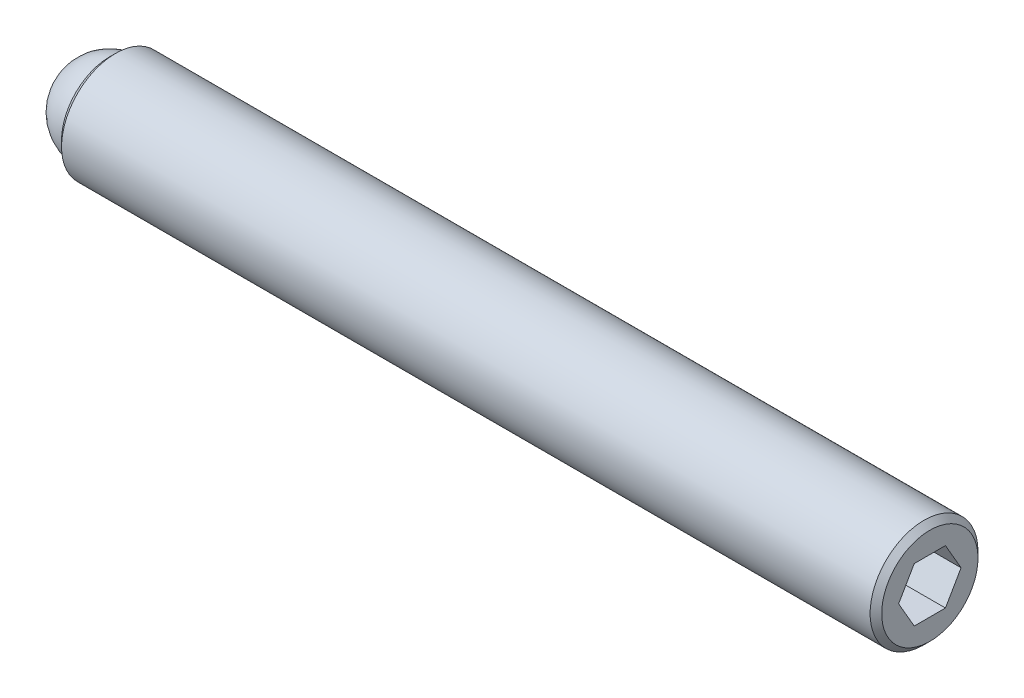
ISO-10303-21;
HEADER;
FILE_DESCRIPTION(('STEP AP214'),'2;1');
FILE_NAME('part.step','',(''),(''),'','','');
FILE_SCHEMA(('AUTOMOTIVE_DESIGN { 1 0 10303 214 1 1 1 1 }'));
ENDSEC;
DATA;
#1=APPLICATION_CONTEXT('core data for automotive mechanical design processes');
#2=APPLICATION_PROTOCOL_DEFINITION('international standard','automotive_design',2000,#1);
#3=PRODUCT_CONTEXT('',#1,'mechanical');
#4=PRODUCT('Part','Part','',(#3));
#5=PRODUCT_RELATED_PRODUCT_CATEGORY('part','',(#4));
#6=PRODUCT_DEFINITION_FORMATION('','',#4);
#7=PRODUCT_DEFINITION_CONTEXT('part definition',#1,'design');
#8=PRODUCT_DEFINITION('design','',#6,#7);
#9=PRODUCT_DEFINITION_SHAPE('','',#8);
#10=(LENGTH_UNIT() NAMED_UNIT(*) SI_UNIT(.MILLI.,.METRE.));
#11=(NAMED_UNIT(*) PLANE_ANGLE_UNIT() SI_UNIT($,.RADIAN.));
#12=(NAMED_UNIT(*) SI_UNIT($,.STERADIAN.) SOLID_ANGLE_UNIT());
#13=UNCERTAINTY_MEASURE_WITH_UNIT(LENGTH_MEASURE(1.E-05),#10,'distance_accuracy_value','');
#14=(GEOMETRIC_REPRESENTATION_CONTEXT(3) GLOBAL_UNCERTAINTY_ASSIGNED_CONTEXT((#13)) GLOBAL_UNIT_ASSIGNED_CONTEXT((#10,
#11,#12)) REPRESENTATION_CONTEXT('',''));
#15=CARTESIAN_POINT('',(0.,0.,0.));
#16=DIRECTION('',(0.,0.,1.));
#17=DIRECTION('',(1.,0.,0.));
#18=AXIS2_PLACEMENT_3D('',#15,#16,#17);
#19=CARTESIAN_POINT('',(0.,0.,0.));
#20=DIRECTION('',(0.,-1.,0.));
#21=DIRECTION('',(0.,0.,1.));
#22=AXIS2_PLACEMENT_3D('',#19,#20,#21);
#23=SPHERICAL_SURFACE('',#22,1.984375);
#24=CARTESIAN_POINT('',(0.,-1.984375,0.));
#25=VERTEX_POINT('',#24);
#26=VERTEX_LOOP('',#25);
#27=FACE_BOUND('',#26,.T.);
#28=ADVANCED_FACE('F41',(#27),#23,.T.);
#29=CLOSED_SHELL('',(#28));
#30=MANIFOLD_SOLID_BREP('B2',#29);
#31=CARTESIAN_POINT('',(36.115625,0.,0.));
#32=DIRECTION('',(-1.,0.,0.));
#33=DIRECTION('',(0.,0.,1.));
#34=AXIS2_PLACEMENT_3D('',#31,#32,#33);
#35=CYLINDRICAL_SURFACE('',#34,2.3749);
#36=CARTESIAN_POINT('',(35.861625,0.,0.));
#37=DIRECTION('',(1.,0.,0.));
#38=DIRECTION('',(0.,0.,-1.));
#39=AXIS2_PLACEMENT_3D('',#36,#37,#38);
#40=CIRCLE('',#39,2.3749);
#41=CARTESIAN_POINT('',(35.861625,0.,-2.3749));
#42=VERTEX_POINT('',#41);
#43=EDGE_CURVE('E39',#42,#42,#40,.F.);
#44=ORIENTED_EDGE('',*,*,#43,.T.);
#45=EDGE_LOOP('',(#44));
#46=FACE_BOUND('',#45,.T.);
#47=CARTESIAN_POINT('',(0.254000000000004,0.,0.));
#48=DIRECTION('',(1.,0.,0.));
#49=DIRECTION('',(0.,0.,-1.));
#50=AXIS2_PLACEMENT_3D('',#47,#48,#49);
#51=CIRCLE('',#50,2.3749);
#52=CARTESIAN_POINT('',(0.254000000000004,0.,-2.3749));
#53=VERTEX_POINT('',#52);
#54=EDGE_CURVE('E157',#53,#53,#51,.T.);
#55=ORIENTED_EDGE('',*,*,#54,.T.);
#56=EDGE_LOOP('',(#55));
#57=FACE_BOUND('',#56,.T.);
#58=ADVANCED_FACE('F54',(#46,#57),#35,.T.);
#59=CARTESIAN_POINT('',(36.115625,0.,0.));
#60=DIRECTION('',(1.,0.,0.));
#61=DIRECTION('',(0.,0.,-1.));
#62=AXIS2_PLACEMENT_3D('',#59,#60,#61);
#63=PLANE('',#62);
#64=DIRECTION('',(0.,0.866025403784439,-0.5));
#65=VECTOR('',#64,1.);
#66=CARTESIAN_POINT('',(36.115625,-1.190625,-0.687407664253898));
#67=LINE('',#66,#65);
#68=CARTESIAN_POINT('',(36.115625,-1.190625,-0.687407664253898));
#69=VERTEX_POINT('',#68);
#70=CARTESIAN_POINT('',(36.115625,0.,-1.3748153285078));
#71=VERTEX_POINT('',#70);
#72=EDGE_CURVE('E69',#69,#71,#67,.T.);
#73=ORIENTED_EDGE('',*,*,#72,.F.);
#74=DIRECTION('',(0.,0.,-1.));
#75=VECTOR('',#74,1.);
#76=CARTESIAN_POINT('',(36.115625,-1.190625,0.687407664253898));
#77=LINE('',#76,#75);
#78=CARTESIAN_POINT('',(36.115625,-1.190625,0.687407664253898));
#79=VERTEX_POINT('',#78);
#80=EDGE_CURVE('E153',#79,#69,#77,.T.);
#81=ORIENTED_EDGE('',*,*,#80,.F.);
#82=DIRECTION('',(0.,-0.866025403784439,-0.5));
#83=VECTOR('',#82,1.);
#84=CARTESIAN_POINT('',(36.115625,0.,1.3748153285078));
#85=LINE('',#84,#83);
#86=CARTESIAN_POINT('',(36.115625,0.,1.3748153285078));
#87=VERTEX_POINT('',#86);
#88=EDGE_CURVE('E151',#87,#79,#85,.T.);
#89=ORIENTED_EDGE('',*,*,#88,.F.);
#90=DIRECTION('',(0.,-0.866025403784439,0.5));
#91=VECTOR('',#90,1.);
#92=CARTESIAN_POINT('',(36.115625,1.190625,0.687407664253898));
#93=LINE('',#92,#91);
#94=CARTESIAN_POINT('',(36.115625,1.190625,0.687407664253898));
#95=VERTEX_POINT('',#94);
#96=EDGE_CURVE('E117',#95,#87,#93,.T.);
#97=ORIENTED_EDGE('',*,*,#96,.F.);
#98=DIRECTION('',(0.,0.,1.));
#99=VECTOR('',#98,1.);
#100=CARTESIAN_POINT('',(36.115625,1.190625,-0.687407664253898));
#101=LINE('',#100,#99);
#102=CARTESIAN_POINT('',(36.115625,1.190625,-0.687407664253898));
#103=VERTEX_POINT('',#102);
#104=EDGE_CURVE('E147',#103,#95,#101,.T.);
#105=ORIENTED_EDGE('',*,*,#104,.F.);
#106=DIRECTION('',(0.,0.866025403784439,0.5));
#107=VECTOR('',#106,1.);
#108=CARTESIAN_POINT('',(36.115625,0.,-1.3748153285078));
#109=LINE('',#108,#107);
#110=EDGE_CURVE('E143',#71,#103,#109,.T.);
#111=ORIENTED_EDGE('',*,*,#110,.F.);
#112=EDGE_LOOP('',(#73,#81,#89,#97,#105,#111));
#113=FACE_BOUND('',#112,.T.);
#114=CARTESIAN_POINT('',(36.115625,0.,0.));
#115=DIRECTION('',(1.,0.,0.));
#116=DIRECTION('',(0.,0.,-1.));
#117=AXIS2_PLACEMENT_3D('',#114,#115,#116);
#118=CIRCLE('',#117,2.1209);
#119=CARTESIAN_POINT('',(36.115625,0.,-2.1209));
#120=VERTEX_POINT('',#119);
#121=EDGE_CURVE('E62',#120,#120,#118,.T.);
#122=ORIENTED_EDGE('',*,*,#121,.T.);
#123=EDGE_LOOP('',(#122));
#124=FACE_BOUND('',#123,.T.);
#125=ADVANCED_FACE('F170',(#113,#124),#63,.T.);
#126=CARTESIAN_POINT('',(0.,0.,0.));
#127=DIRECTION('',(1.,0.,0.));
#128=DIRECTION('',(0.,0.,-1.));
#129=AXIS2_PLACEMENT_3D('',#126,#127,#128);
#130=PLANE('',#129);
#131=CARTESIAN_POINT('',(0.,0.,0.));
#132=DIRECTION('',(-1.,0.,0.));
#133=DIRECTION('',(0.,0.,1.));
#134=AXIS2_PLACEMENT_3D('',#131,#132,#133);
#135=CIRCLE('',#134,1.9812);
#136=CARTESIAN_POINT('',(0.,0.,1.9812));
#137=VERTEX_POINT('',#136);
#138=EDGE_CURVE('E225',#137,#137,#135,.T.);
#139=ORIENTED_EDGE('',*,*,#138,.F.);
#140=EDGE_LOOP('',(#139));
#141=FACE_BOUND('',#140,.T.);
#142=CARTESIAN_POINT('',(0.,0.,0.));
#143=DIRECTION('',(1.,0.,0.));
#144=DIRECTION('',(0.,0.,-1.));
#145=AXIS2_PLACEMENT_3D('',#142,#143,#144);
#146=CIRCLE('',#145,2.12089999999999);
#147=CARTESIAN_POINT('',(0.,0.,-2.12089999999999));
#148=VERTEX_POINT('',#147);
#149=EDGE_CURVE('E165',#148,#148,#146,.F.);
#150=ORIENTED_EDGE('',*,*,#149,.T.);
#151=EDGE_LOOP('',(#150));
#152=FACE_BOUND('',#151,.T.);
#153=ADVANCED_FACE('F182',(#141,#152),#130,.F.);
#154=CARTESIAN_POINT('',(0.254000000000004,0.,0.));
#155=DIRECTION('',(1.,0.,0.));
#156=DIRECTION('',(0.,0.,-1.));
#157=AXIS2_PLACEMENT_3D('',#154,#155,#156);
#158=CONICAL_SURFACE('',#157,2.3749,0.785398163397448);
#159=ORIENTED_EDGE('',*,*,#149,.F.);
#160=EDGE_LOOP('',(#159));
#161=FACE_BOUND('',#160,.T.);
#162=ORIENTED_EDGE('',*,*,#54,.F.);
#163=EDGE_LOOP('',(#162));
#164=FACE_BOUND('',#163,.T.);
#165=ADVANCED_FACE('F174',(#161,#164),#158,.T.);
#166=CARTESIAN_POINT('',(36.115625,0.,0.));
#167=DIRECTION('',(-1.,0.,0.));
#168=DIRECTION('',(0.,0.,1.));
#169=AXIS2_PLACEMENT_3D('',#166,#167,#168);
#170=CONICAL_SURFACE('',#169,2.1209,0.785398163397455);
#171=ORIENTED_EDGE('',*,*,#43,.F.);
#172=EDGE_LOOP('',(#171));
#173=FACE_BOUND('',#172,.T.);
#174=ORIENTED_EDGE('',*,*,#121,.F.);
#175=EDGE_LOOP('',(#174));
#176=FACE_BOUND('',#175,.T.);
#177=ADVANCED_FACE('F56',(#173,#176),#170,.T.);
#178=CARTESIAN_POINT('',(33.829625,-1.190625,-0.687407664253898));
#179=DIRECTION('',(0.,-0.5,-0.866025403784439));
#180=DIRECTION('',(0.,0.866025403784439,-0.5));
#181=AXIS2_PLACEMENT_3D('',#178,#179,#180);
#182=PLANE('',#181);
#183=ORIENTED_EDGE('',*,*,#72,.T.);
#184=DIRECTION('',(1.,0.,0.));
#185=VECTOR('',#184,1.);
#186=CARTESIAN_POINT('',(33.829625,0.,-1.3748153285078));
#187=LINE('',#186,#185);
#188=CARTESIAN_POINT('',(33.829625,0.,-1.3748153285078));
#189=VERTEX_POINT('',#188);
#190=EDGE_CURVE('E99',#189,#71,#187,.T.);
#191=ORIENTED_EDGE('',*,*,#190,.F.);
#192=DIRECTION('',(0.,0.866025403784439,-0.5));
#193=VECTOR('',#192,1.);
#194=CARTESIAN_POINT('',(33.829625,-1.190625,-0.687407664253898));
#195=LINE('',#194,#193);
#196=CARTESIAN_POINT('',(33.829625,-1.190625,-0.687407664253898));
#197=VERTEX_POINT('',#196);
#198=EDGE_CURVE('E155',#197,#189,#195,.T.);
#199=ORIENTED_EDGE('',*,*,#198,.F.);
#200=DIRECTION('',(1.,0.,0.));
#201=VECTOR('',#200,1.);
#202=CARTESIAN_POINT('',(33.829625,-1.190625,-0.687407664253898));
#203=LINE('',#202,#201);
#204=EDGE_CURVE('E77',#197,#69,#203,.T.);
#205=ORIENTED_EDGE('',*,*,#204,.T.);
#206=EDGE_LOOP('',(#183,#191,#199,#205));
#207=FACE_BOUND('',#206,.T.);
#208=ADVANCED_FACE('F173',(#207),#182,.F.);
#209=CARTESIAN_POINT('',(33.829625,-1.190625,0.687407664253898));
#210=DIRECTION('',(0.,-1.,0.));
#211=DIRECTION('',(0.,0.,-1.));
#212=AXIS2_PLACEMENT_3D('',#209,#210,#211);
#213=PLANE('',#212);
#214=ORIENTED_EDGE('',*,*,#80,.T.);
#215=ORIENTED_EDGE('',*,*,#204,.F.);
#216=DIRECTION('',(0.,0.,-1.));
#217=VECTOR('',#216,1.);
#218=CARTESIAN_POINT('',(33.829625,-1.190625,0.687407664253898));
#219=LINE('',#218,#217);
#220=CARTESIAN_POINT('',(33.829625,-1.190625,0.687407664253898));
#221=VERTEX_POINT('',#220);
#222=EDGE_CURVE('E129',#221,#197,#219,.T.);
#223=ORIENTED_EDGE('',*,*,#222,.F.);
#224=DIRECTION('',(1.,0.,0.));
#225=VECTOR('',#224,1.);
#226=CARTESIAN_POINT('',(33.829625,-1.190625,0.687407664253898));
#227=LINE('',#226,#225);
#228=EDGE_CURVE('E121',#221,#79,#227,.T.);
#229=ORIENTED_EDGE('',*,*,#228,.T.);
#230=EDGE_LOOP('',(#214,#215,#223,#229));
#231=FACE_BOUND('',#230,.T.);
#232=ADVANCED_FACE('F180',(#231),#213,.F.);
#233=CARTESIAN_POINT('',(33.829625,0.,1.3748153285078));
#234=DIRECTION('',(0.,-0.5,0.866025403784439));
#235=DIRECTION('',(0.,-0.866025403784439,-0.5));
#236=AXIS2_PLACEMENT_3D('',#233,#234,#235);
#237=PLANE('',#236);
#238=ORIENTED_EDGE('',*,*,#88,.T.);
#239=ORIENTED_EDGE('',*,*,#228,.F.);
#240=DIRECTION('',(0.,-0.866025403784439,-0.5));
#241=VECTOR('',#240,1.);
#242=CARTESIAN_POINT('',(33.829625,0.,1.3748153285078));
#243=LINE('',#242,#241);
#244=CARTESIAN_POINT('',(33.829625,0.,1.3748153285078));
#245=VERTEX_POINT('',#244);
#246=EDGE_CURVE('E125',#245,#221,#243,.T.);
#247=ORIENTED_EDGE('',*,*,#246,.F.);
#248=DIRECTION('',(1.,0.,0.));
#249=VECTOR('',#248,1.);
#250=CARTESIAN_POINT('',(33.829625,0.,1.3748153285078));
#251=LINE('',#250,#249);
#252=EDGE_CURVE('E110',#245,#87,#251,.T.);
#253=ORIENTED_EDGE('',*,*,#252,.T.);
#254=EDGE_LOOP('',(#238,#239,#247,#253));
#255=FACE_BOUND('',#254,.T.);
#256=ADVANCED_FACE('F126',(#255),#237,.F.);
#257=CARTESIAN_POINT('',(33.829625,1.190625,0.687407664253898));
#258=DIRECTION('',(0.,0.5,0.866025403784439));
#259=DIRECTION('',(0.,-0.866025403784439,0.5));
#260=AXIS2_PLACEMENT_3D('',#257,#258,#259);
#261=PLANE('',#260);
#262=ORIENTED_EDGE('',*,*,#96,.T.);
#263=ORIENTED_EDGE('',*,*,#252,.F.);
#264=DIRECTION('',(0.,-0.866025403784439,0.5));
#265=VECTOR('',#264,1.);
#266=CARTESIAN_POINT('',(33.829625,1.190625,0.687407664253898));
#267=LINE('',#266,#265);
#268=CARTESIAN_POINT('',(33.829625,1.190625,0.687407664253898));
#269=VERTEX_POINT('',#268);
#270=EDGE_CURVE('E114',#269,#245,#267,.T.);
#271=ORIENTED_EDGE('',*,*,#270,.F.);
#272=DIRECTION('',(1.,0.,0.));
#273=VECTOR('',#272,1.);
#274=CARTESIAN_POINT('',(33.829625,1.190625,0.687407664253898));
#275=LINE('',#274,#273);
#276=EDGE_CURVE('E122',#269,#95,#275,.T.);
#277=ORIENTED_EDGE('',*,*,#276,.T.);
#278=EDGE_LOOP('',(#262,#263,#271,#277));
#279=FACE_BOUND('',#278,.T.);
#280=ADVANCED_FACE('F112',(#279),#261,.F.);
#281=CARTESIAN_POINT('',(33.829625,1.190625,-0.687407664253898));
#282=DIRECTION('',(0.,1.,0.));
#283=DIRECTION('',(0.,0.,1.));
#284=AXIS2_PLACEMENT_3D('',#281,#282,#283);
#285=PLANE('',#284);
#286=ORIENTED_EDGE('',*,*,#104,.T.);
#287=ORIENTED_EDGE('',*,*,#276,.F.);
#288=DIRECTION('',(0.,0.,1.));
#289=VECTOR('',#288,1.);
#290=CARTESIAN_POINT('',(33.829625,1.190625,-0.687407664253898));
#291=LINE('',#290,#289);
#292=CARTESIAN_POINT('',(33.829625,1.190625,-0.687407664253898));
#293=VERTEX_POINT('',#292);
#294=EDGE_CURVE('E135',#293,#269,#291,.T.);
#295=ORIENTED_EDGE('',*,*,#294,.F.);
#296=DIRECTION('',(1.,0.,0.));
#297=VECTOR('',#296,1.);
#298=CARTESIAN_POINT('',(33.829625,1.190625,-0.687407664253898));
#299=LINE('',#298,#297);
#300=EDGE_CURVE('E160',#293,#103,#299,.T.);
#301=ORIENTED_EDGE('',*,*,#300,.T.);
#302=EDGE_LOOP('',(#286,#287,#295,#301));
#303=FACE_BOUND('',#302,.T.);
#304=ADVANCED_FACE('F201',(#303),#285,.F.);
#305=CARTESIAN_POINT('',(33.829625,0.,-1.3748153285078));
#306=DIRECTION('',(0.,0.5,-0.866025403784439));
#307=DIRECTION('',(0.,0.866025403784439,0.5));
#308=AXIS2_PLACEMENT_3D('',#305,#306,#307);
#309=PLANE('',#308);
#310=ORIENTED_EDGE('',*,*,#110,.T.);
#311=ORIENTED_EDGE('',*,*,#300,.F.);
#312=DIRECTION('',(0.,0.866025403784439,0.5));
#313=VECTOR('',#312,1.);
#314=CARTESIAN_POINT('',(33.829625,0.,-1.3748153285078));
#315=LINE('',#314,#313);
#316=EDGE_CURVE('E137',#189,#293,#315,.T.);
#317=ORIENTED_EDGE('',*,*,#316,.F.);
#318=ORIENTED_EDGE('',*,*,#190,.T.);
#319=EDGE_LOOP('',(#310,#311,#317,#318));
#320=FACE_BOUND('',#319,.T.);
#321=ADVANCED_FACE('F198',(#320),#309,.F.);
#322=CARTESIAN_POINT('',(33.829625,0.,0.));
#323=DIRECTION('',(1.,0.,0.));
#324=DIRECTION('',(0.,0.,-1.));
#325=AXIS2_PLACEMENT_3D('',#322,#323,#324);
#326=PLANE('',#325);
#327=ORIENTED_EDGE('',*,*,#198,.T.);
#328=ORIENTED_EDGE('',*,*,#316,.T.);
#329=ORIENTED_EDGE('',*,*,#294,.T.);
#330=ORIENTED_EDGE('',*,*,#270,.T.);
#331=ORIENTED_EDGE('',*,*,#246,.T.);
#332=ORIENTED_EDGE('',*,*,#222,.T.);
#333=EDGE_LOOP('',(#327,#328,#329,#330,#331,#332));
#334=FACE_BOUND('',#333,.T.);
#335=ADVANCED_FACE('F132',(#334),#326,.T.);
#336=CARTESIAN_POINT('',(1.984375,0.,0.));
#337=DIRECTION('',(-1.,0.,0.));
#338=DIRECTION('',(0.,0.,1.));
#339=AXIS2_PLACEMENT_3D('',#336,#337,#338);
#340=CYLINDRICAL_SURFACE('',#339,1.9812);
#341=CARTESIAN_POINT('',(1.984375,0.,0.));
#342=DIRECTION('',(-1.,0.,0.));
#343=DIRECTION('',(0.,0.,1.));
#344=AXIS2_PLACEMENT_3D('',#341,#342,#343);
#345=CIRCLE('',#344,1.9812);
#346=CARTESIAN_POINT('',(1.984375,0.,1.9812));
#347=VERTEX_POINT('',#346);
#348=EDGE_CURVE('E144',#347,#347,#345,.T.);
#349=ORIENTED_EDGE('',*,*,#348,.F.);
#350=EDGE_LOOP('',(#349));
#351=FACE_BOUND('',#350,.T.);
#352=ORIENTED_EDGE('',*,*,#138,.T.);
#353=EDGE_LOOP('',(#352));
#354=FACE_BOUND('',#353,.T.);
#355=ADVANCED_FACE('F214',(#351,#354),#340,.F.);
#356=CARTESIAN_POINT('',(1.984375,0.,0.));
#357=DIRECTION('',(-1.,0.,0.));
#358=DIRECTION('',(0.,0.,1.));
#359=AXIS2_PLACEMENT_3D('',#356,#357,#358);
#360=PLANE('',#359);
#361=ORIENTED_EDGE('',*,*,#348,.T.);
#362=EDGE_LOOP('',(#361));
#363=FACE_BOUND('',#362,.T.);
#364=ADVANCED_FACE('F217',(#363),#360,.T.);
#365=CLOSED_SHELL('',(#58,#125,#153,#165,#177,#208,#232,#256,#280,#304,#321,#335,#355,#364));
#366=MANIFOLD_SOLID_BREP('B6',#365);
#367=ADVANCED_BREP_SHAPE_REPRESENTATION('',(#18,#30,#366),#14);
#368=SHAPE_DEFINITION_REPRESENTATION(#9,#367);
ENDSEC;
END-ISO-10303-21;
